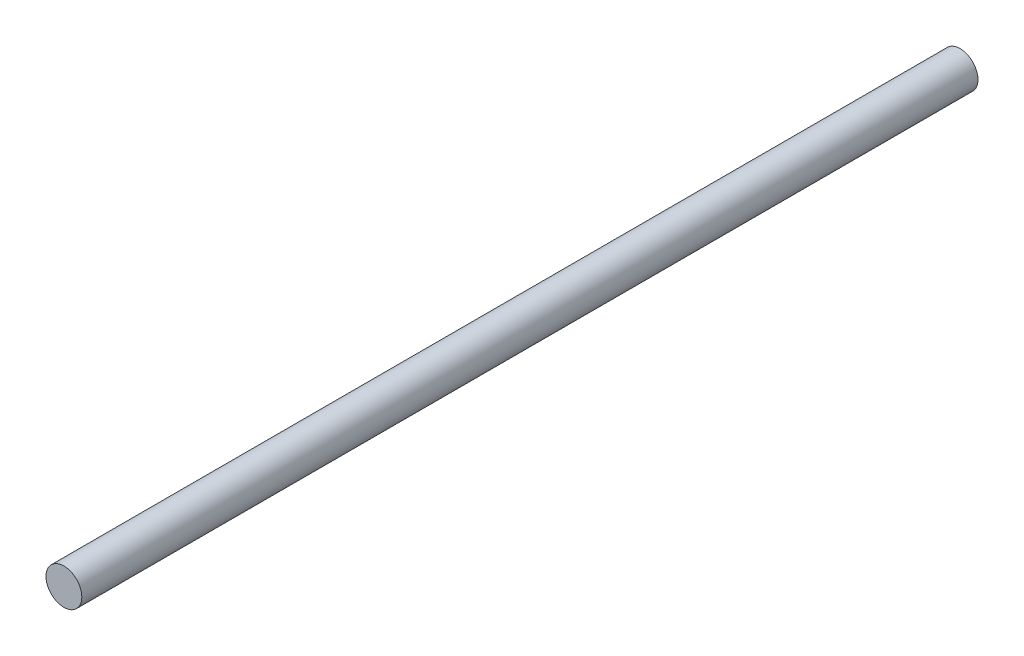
ISO-10303-21;
HEADER;
FILE_DESCRIPTION(('STEP AP214'),'2;1');
FILE_NAME('part.step','',(''),(''),'','','');
FILE_SCHEMA(('AUTOMOTIVE_DESIGN { 1 0 10303 214 1 1 1 1 }'));
ENDSEC;
DATA;
#1=APPLICATION_CONTEXT('core data for automotive mechanical design processes');
#2=APPLICATION_PROTOCOL_DEFINITION('international standard','automotive_design',2000,#1);
#3=PRODUCT_CONTEXT('',#1,'mechanical');
#4=PRODUCT('Part','Part','',(#3));
#5=PRODUCT_RELATED_PRODUCT_CATEGORY('part','',(#4));
#6=PRODUCT_DEFINITION_FORMATION('','',#4);
#7=PRODUCT_DEFINITION_CONTEXT('part definition',#1,'design');
#8=PRODUCT_DEFINITION('design','',#6,#7);
#9=PRODUCT_DEFINITION_SHAPE('','',#8);
#10=(LENGTH_UNIT() NAMED_UNIT(*) SI_UNIT(.MILLI.,.METRE.));
#11=(NAMED_UNIT(*) PLANE_ANGLE_UNIT() SI_UNIT($,.RADIAN.));
#12=(NAMED_UNIT(*) SI_UNIT($,.STERADIAN.) SOLID_ANGLE_UNIT());
#13=UNCERTAINTY_MEASURE_WITH_UNIT(LENGTH_MEASURE(1.E-05),#10,'distance_accuracy_value','');
#14=(GEOMETRIC_REPRESENTATION_CONTEXT(3) GLOBAL_UNCERTAINTY_ASSIGNED_CONTEXT((#13)) GLOBAL_UNIT_ASSIGNED_CONTEXT((#10,
#11,#12)) REPRESENTATION_CONTEXT('',''));
#15=CARTESIAN_POINT('',(0.,0.,0.));
#16=DIRECTION('',(0.,0.,1.));
#17=DIRECTION('',(1.,0.,0.));
#18=AXIS2_PLACEMENT_3D('',#15,#16,#17);
#19=CARTESIAN_POINT('',(-20.9468820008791,0.,11.0540659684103));
#20=DIRECTION('',(0.,0.,1.));
#21=DIRECTION('',(1.,0.,0.));
#22=AXIS2_PLACEMENT_3D('',#19,#20,#21);
#23=PLANE('',#22);
#24=CARTESIAN_POINT('',(-20.9468820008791,0.,11.0540659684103));
#25=DIRECTION('',(0.,0.,1.));
#26=DIRECTION('',(1.,0.,0.));
#27=AXIS2_PLACEMENT_3D('',#24,#25,#26);
#28=CIRCLE('',#27,0.635);
#29=CARTESIAN_POINT('',(-20.3118820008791,0.,11.0540659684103));
#30=VERTEX_POINT('',#29);
#31=EDGE_CURVE('E10',#30,#30,#28,.T.);
#32=ORIENTED_EDGE('',*,*,#31,.F.);
#33=EDGE_LOOP('',(#32));
#34=FACE_BOUND('',#33,.T.);
#35=ADVANCED_FACE('F29',(#34),#23,.F.);
#36=CARTESIAN_POINT('',(-20.9468820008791,0.,42.8040659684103));
#37=DIRECTION('',(0.,0.,1.));
#38=DIRECTION('',(1.,0.,0.));
#39=AXIS2_PLACEMENT_3D('',#36,#37,#38);
#40=CYLINDRICAL_SURFACE('',#39,0.635000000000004);
#41=CARTESIAN_POINT('',(-20.9468820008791,0.,42.8040659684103));
#42=DIRECTION('',(0.,0.,1.));
#43=DIRECTION('',(1.,0.,0.));
#44=AXIS2_PLACEMENT_3D('',#41,#42,#43);
#45=CIRCLE('',#44,0.635000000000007);
#46=CARTESIAN_POINT('',(-20.3118820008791,0.,42.8040659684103));
#47=VERTEX_POINT('',#46);
#48=EDGE_CURVE('E35',#47,#47,#45,.T.);
#49=ORIENTED_EDGE('',*,*,#48,.F.);
#50=EDGE_LOOP('',(#49));
#51=FACE_BOUND('',#50,.T.);
#52=ORIENTED_EDGE('',*,*,#31,.T.);
#53=EDGE_LOOP('',(#52));
#54=FACE_BOUND('',#53,.T.);
#55=ADVANCED_FACE('F43',(#51,#54),#40,.T.);
#56=CARTESIAN_POINT('',(-21.5818820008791,0.,42.8040659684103));
#57=DIRECTION('',(0.,0.,-1.));
#58=DIRECTION('',(-1.,0.,0.));
#59=AXIS2_PLACEMENT_3D('',#56,#57,#58);
#60=PLANE('',#59);
#61=ORIENTED_EDGE('',*,*,#48,.T.);
#62=EDGE_LOOP('',(#61));
#63=FACE_BOUND('',#62,.T.);
#64=ADVANCED_FACE('F41',(#63),#60,.F.);
#65=CLOSED_SHELL('',(#35,#55,#64));
#66=MANIFOLD_SOLID_BREP('B2',#65);
#67=ADVANCED_BREP_SHAPE_REPRESENTATION('',(#18,#66),#14);
#68=SHAPE_DEFINITION_REPRESENTATION(#9,#67);
ENDSEC;
END-ISO-10303-21;
